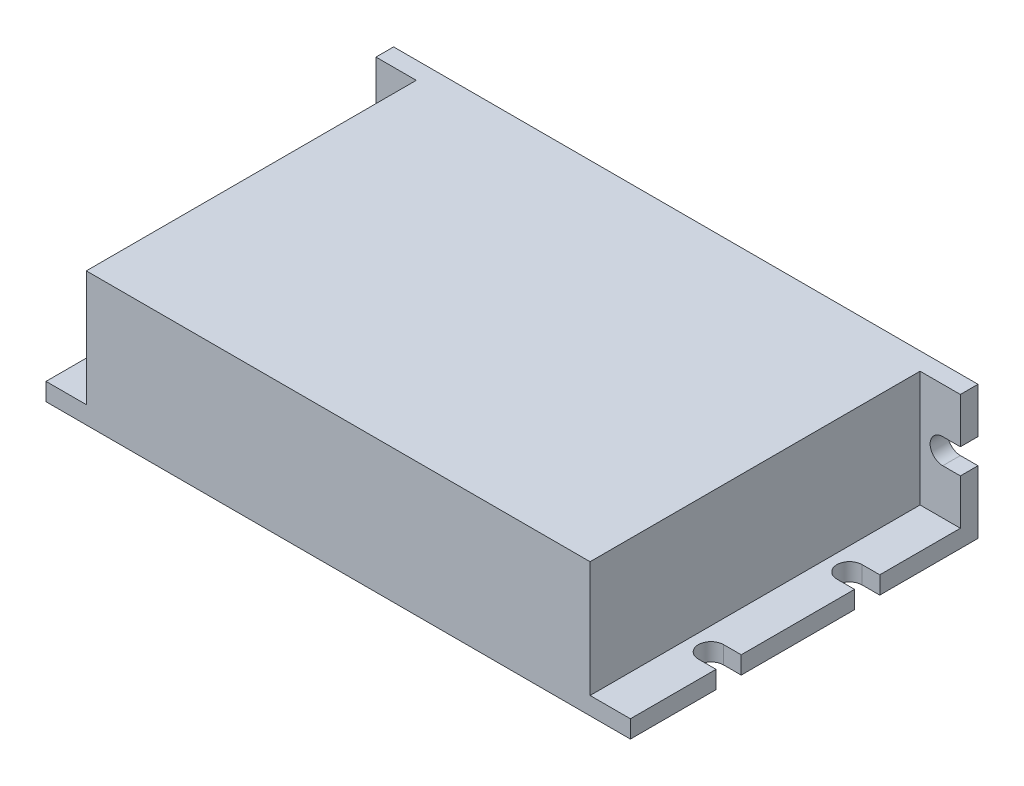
from build123d import *

# Parameters (mm, degrees)
SKETCH_1_W          = 116
SKETCH_1_H          = 69
EXTRUDE_1_DEPTH     = 26.5
SKETCH_2_W          = 8
SKETCH_2_H          = 23
CUT_EXTRUDE_1_DEPTH = 65.5
CUT_EXTRUDE_2_DEPTH = 3.5
CUT_EXTRUDE_3_DEPTH = 3.5


with BuildPart() as part:
    # Sketch 1 → Extrude 1 (new body)
    with BuildSketch(Plane(origin=(0, 0, 0), x_dir=(1, 0, 0), z_dir=(0, 1, 0))):
        with Locations((58, 34.5)):
            Rectangle(SKETCH_1_W, SKETCH_1_H)
    extrude(amount=EXTRUDE_1_DEPTH)

    # Sketch 2 → Cut-Extrude 1 (cut)
    with BuildSketch(Plane.XY):
        with Locations((4, 15)):
            Rectangle(SKETCH_2_W, SKETCH_2_H)
        with Locations((112, 15)):
            Rectangle(SKETCH_2_W, SKETCH_2_H)
    extrude(amount=-CUT_EXTRUDE_1_DEPTH, mode=Mode.SUBTRACT)

    # Sketch 3 → Cut-Extrude 2 (cut)
    with BuildSketch(Plane.XY.offset(-65.5)):
        with BuildLine():
            Line((3.5, 17.5), (0, 17.5))
            Line((0, 17.5), (0, 12.5))
            Line((0, 12.5), (3.5, 12.5))
            ThreePointArc((3.5, 12.5), (6, 15), (3.5, 17.5))
        make_face()
        with BuildLine():
            Line((112.5, 17.5), (116, 17.5))
            Line((116, 17.5), (116, 12.5))
            Line((116, 12.5), (112.5, 12.5))
            ThreePointArc((112.5, 12.5), (110, 15), (112.5, 17.5))
        make_face()
    extrude(amount=-CUT_EXTRUDE_2_DEPTH, mode=Mode.SUBTRACT)

    # Sketch 4 → Cut-Extrude 3 (cut)
    with BuildSketch(Plane(origin=(0, 0, 0), x_dir=(1, 0, 0), z_dir=(0, 1, 0))):
        with BuildLine():
            Line((112.5, 49.5), (116, 49.5))
            Line((116, 49.5), (116, 44.5))
            Line((116, 44.5), (112.5, 44.5))
            ThreePointArc((112.5, 44.5), (110, 47), (112.5, 49.5))
        make_face()
        with BuildLine():
            Line((112.5, 22), (116, 22))
            Line((116, 22), (116, 17))
            Line((116, 17), (112.5, 17))
            ThreePointArc((112.5, 17), (110, 19.5), (112.5, 22))
        make_face()
        with BuildLine():
            Line((3.5, 49.5), (0, 49.5))
            Line((0, 49.5), (0, 44.5))
            Line((0, 44.5), (3.5, 44.5))
            ThreePointArc((3.5, 44.5), (6, 47), (3.5, 49.5))
        make_face()
        with BuildLine():
            Line((3.5, 22), (0, 22))
            Line((0, 22), (0, 17))
            Line((0, 17), (3.5, 17))
            ThreePointArc((3.5, 17), (6, 19.5), (3.5, 22))
        make_face()
    extrude(amount=CUT_EXTRUDE_3_DEPTH, mode=Mode.SUBTRACT)


solid = part.part
